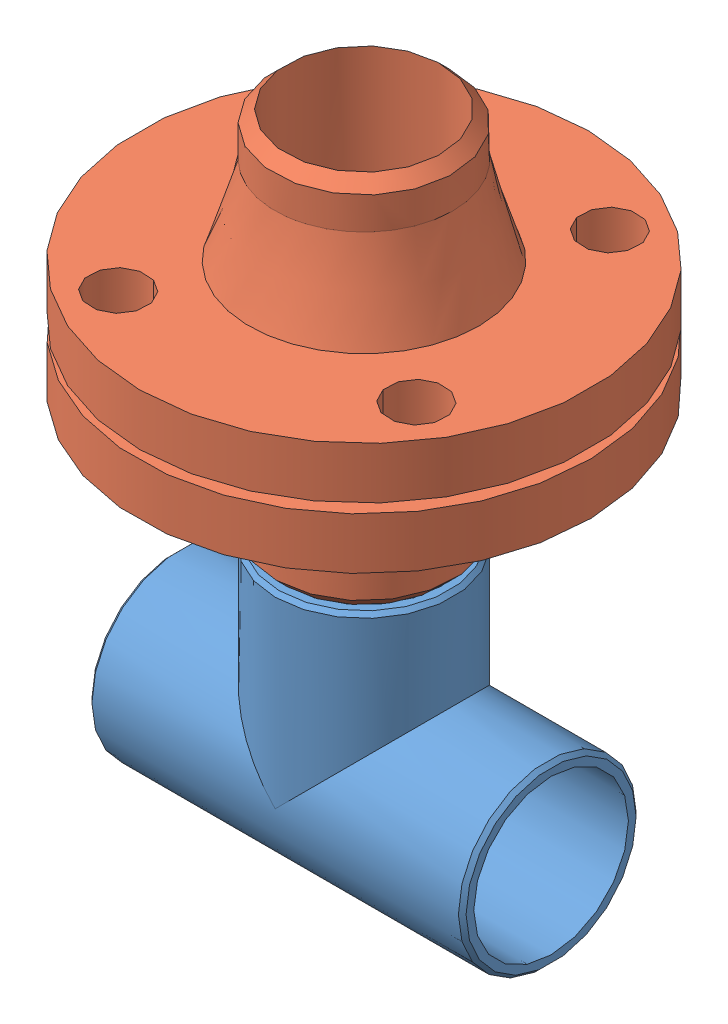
SolidWorks assembly assembly fitting.sldasm, configuration 2 inch (file format 9000). Lengths in mm.
Overall size (202.18 240.79 202.18).
3 component instances, 2 part files, 4 mates.
Components (placement in the parent):
- straight tee inch-1: straight tee inch.sldprt [Tee Inch 2 Sch40] at origin size (147 103.66 60.32)
- welding neck flange-1: welding neck flange.sldprt [WNeck Flange 150-NPS2] at (0 125.476 0) x (0.908284 0 -0.418355) z (0 1 0) size (152.4 152.4 73.57)
- welding neck flange-2: welding neck flange.sldprt [WNeck Flange 150-NPS2] at (0 128.651 0) x (0.20828 0 0.978069) z (0 -1 0) size (152.4 152.4 73.57)
Mates (geometry in assembly coordinates):
- Concentric3: concentric aligned: cylinder of straight tee inch-1 through (0 63.5 0) axis (0 -1 0) radius 26.2509; cylinder of welding neck flange-1 through (0 127.0645 0) axis (0 -1 0) radius 26.289
- Coincident3: coincident aligned: plane of straight tee inch-1 through (0 63.5 0) normal (0 1 0); circle of welding neck flange-1
- Concentric4: concentric anti-aligned: cylinder of welding neck flange-1 through (0 127.0645 0) axis (0 -1 0) radius 26.289; cylinder of welding neck flange-2 through (0 127.0625 0) axis (0 1 0) radius 26.289
- Coincident4: coincident anti-aligned: plane of welding neck flange-2 through (0 127.0635 0) normal (0 -1 0); plane of welding neck flange-1 through (0 127.0635 0) normal (0 1 0)
